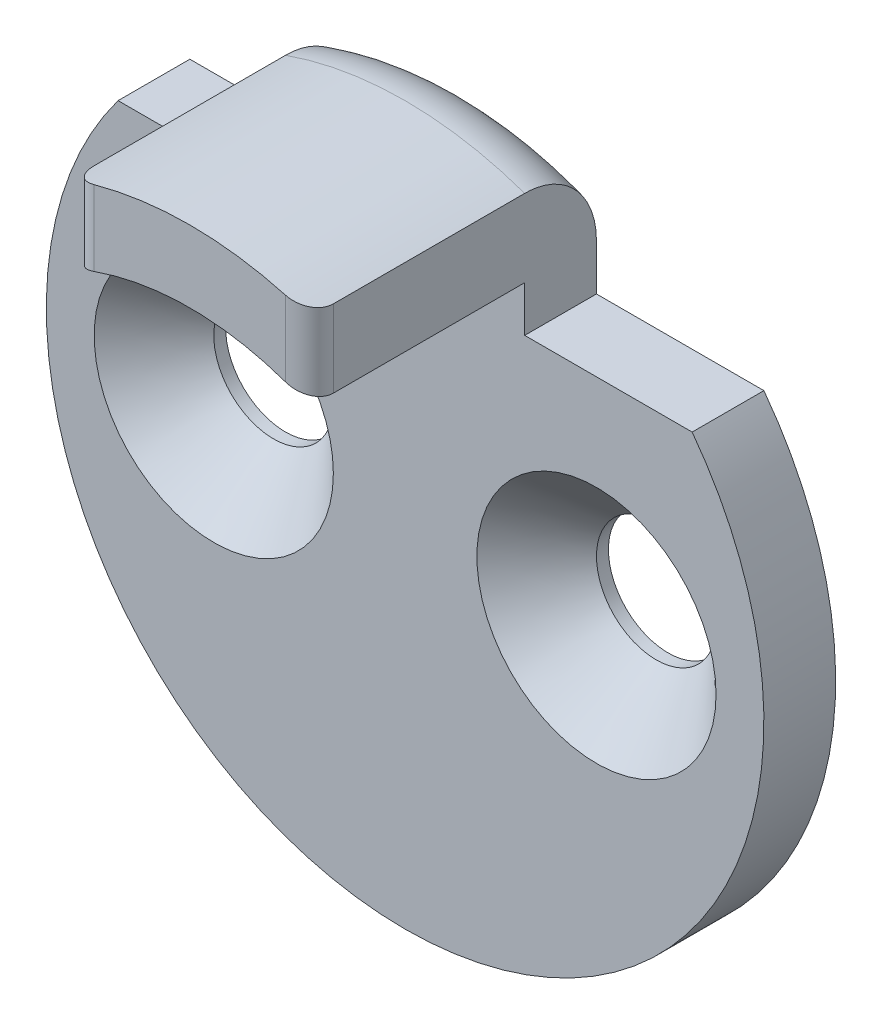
ISO-10303-21;
HEADER;
FILE_DESCRIPTION(('STEP AP214'),'2;1');
FILE_NAME('part.step','',(''),(''),'','','');
FILE_SCHEMA(('AUTOMOTIVE_DESIGN { 1 0 10303 214 1 1 1 1 }'));
ENDSEC;
DATA;
#1=APPLICATION_CONTEXT('core data for automotive mechanical design processes');
#2=APPLICATION_PROTOCOL_DEFINITION('international standard','automotive_design',2000,#1);
#3=PRODUCT_CONTEXT('',#1,'mechanical');
#4=PRODUCT('Part','Part','',(#3));
#5=PRODUCT_RELATED_PRODUCT_CATEGORY('part','',(#4));
#6=PRODUCT_DEFINITION_FORMATION('','',#4);
#7=PRODUCT_DEFINITION_CONTEXT('part definition',#1,'design');
#8=PRODUCT_DEFINITION('design','',#6,#7);
#9=PRODUCT_DEFINITION_SHAPE('','',#8);
#10=(LENGTH_UNIT() NAMED_UNIT(*) SI_UNIT(.MILLI.,.METRE.));
#11=(NAMED_UNIT(*) PLANE_ANGLE_UNIT() SI_UNIT($,.RADIAN.));
#12=(NAMED_UNIT(*) SI_UNIT($,.STERADIAN.) SOLID_ANGLE_UNIT());
#13=UNCERTAINTY_MEASURE_WITH_UNIT(LENGTH_MEASURE(1.E-05),#10,'distance_accuracy_value','');
#14=(GEOMETRIC_REPRESENTATION_CONTEXT(3) GLOBAL_UNCERTAINTY_ASSIGNED_CONTEXT((#13)) GLOBAL_UNIT_ASSIGNED_CONTEXT((#10,
#11,#12)) REPRESENTATION_CONTEXT('',''));
#15=CARTESIAN_POINT('',(0.,0.,0.));
#16=DIRECTION('',(0.,0.,1.));
#17=DIRECTION('',(1.,0.,0.));
#18=AXIS2_PLACEMENT_3D('',#15,#16,#17);
#19=CARTESIAN_POINT('',(0.,0.,1.5));
#20=DIRECTION('',(0.,0.,1.));
#21=DIRECTION('',(1.,0.,0.));
#22=AXIS2_PLACEMENT_3D('',#19,#20,#21);
#23=PLANE('',#22);
#24=CARTESIAN_POINT('',(-4.,0.,1.5));
#25=DIRECTION('',(0.,0.,1.));
#26=DIRECTION('',(1.,0.,0.));
#27=AXIS2_PLACEMENT_3D('',#24,#25,#26);
#28=CIRCLE('',#27,2.5);
#29=CARTESIAN_POINT('',(-1.5,0.,1.5));
#30=VERTEX_POINT('',#29);
#31=EDGE_CURVE('E39',#30,#30,#28,.F.);
#32=ORIENTED_EDGE('',*,*,#31,.T.);
#33=EDGE_LOOP('',(#32));
#34=FACE_BOUND('',#33,.T.);
#35=CARTESIAN_POINT('',(4.,0.,1.5));
#36=DIRECTION('',(0.,0.,1.));
#37=DIRECTION('',(1.,0.,0.));
#38=AXIS2_PLACEMENT_3D('',#35,#36,#37);
#39=CIRCLE('',#38,2.5);
#40=CARTESIAN_POINT('',(6.5,0.,1.5));
#41=VERTEX_POINT('',#40);
#42=EDGE_CURVE('E316',#41,#41,#39,.F.);
#43=ORIENTED_EDGE('',*,*,#42,.T.);
#44=EDGE_LOOP('',(#43));
#45=FACE_BOUND('',#44,.T.);
#46=CARTESIAN_POINT('',(0.,0.,1.5));
#47=DIRECTION('',(0.,0.,-1.));
#48=DIRECTION('',(1.,0.,0.));
#49=AXIS2_PLACEMENT_3D('',#46,#47,#48);
#50=CIRCLE('',#49,6.);
#51=CARTESIAN_POINT('',(-2.5,5.45435605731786,1.5));
#52=VERTEX_POINT('',#51);
#53=CARTESIAN_POINT('',(2.5,5.45435605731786,1.5));
#54=VERTEX_POINT('',#53);
#55=EDGE_CURVE('E125',#52,#54,#50,.T.);
#56=ORIENTED_EDGE('',*,*,#55,.F.);
#57=DIRECTION('',(0.,-1.,0.));
#58=VECTOR('',#57,1.);
#59=CARTESIAN_POINT('',(-2.5,4.5,1.5));
#60=LINE('',#59,#58);
#61=CARTESIAN_POINT('',(-2.5,4.5,1.5));
#62=VERTEX_POINT('',#61);
#63=EDGE_CURVE('E157',#52,#62,#60,.T.);
#64=ORIENTED_EDGE('',*,*,#63,.T.);
#65=DIRECTION('',(-1.,0.,0.));
#66=VECTOR('',#65,1.);
#67=CARTESIAN_POINT('',(-2.5,4.5,1.5));
#68=LINE('',#67,#66);
#69=CARTESIAN_POINT('',(-6.,4.5,1.5));
#70=VERTEX_POINT('',#69);
#71=EDGE_CURVE('E155',#62,#70,#68,.T.);
#72=ORIENTED_EDGE('',*,*,#71,.T.);
#73=CARTESIAN_POINT('',(0.,0.,1.5));
#74=DIRECTION('',(0.,0.,1.));
#75=DIRECTION('',(1.,0.,0.));
#76=AXIS2_PLACEMENT_3D('',#73,#74,#75);
#77=CIRCLE('',#76,7.5);
#78=CARTESIAN_POINT('',(6.,4.5,1.5));
#79=VERTEX_POINT('',#78);
#80=EDGE_CURVE('E185',#70,#79,#77,.T.);
#81=ORIENTED_EDGE('',*,*,#80,.T.);
#82=DIRECTION('',(-1.,0.,0.));
#83=VECTOR('',#82,1.);
#84=CARTESIAN_POINT('',(2.5,4.5,1.5));
#85=LINE('',#84,#83);
#86=CARTESIAN_POINT('',(2.5,4.5,1.5));
#87=VERTEX_POINT('',#86);
#88=EDGE_CURVE('E128',#79,#87,#85,.T.);
#89=ORIENTED_EDGE('',*,*,#88,.T.);
#90=DIRECTION('',(0.,1.,0.));
#91=VECTOR('',#90,1.);
#92=CARTESIAN_POINT('',(2.5,4.5,1.5));
#93=LINE('',#92,#91);
#94=EDGE_CURVE('E117',#87,#54,#93,.T.);
#95=ORIENTED_EDGE('',*,*,#94,.T.);
#96=EDGE_LOOP('',(#56,#64,#72,#81,#89,#95));
#97=FACE_BOUND('',#96,.T.);
#98=ADVANCED_FACE('F31',(#34,#45,#97),#23,.T.);
#99=CARTESIAN_POINT('',(0.,0.,0.));
#100=DIRECTION('',(0.,0.,1.));
#101=DIRECTION('',(1.,0.,0.));
#102=AXIS2_PLACEMENT_3D('',#99,#100,#101);
#103=PLANE('',#102);
#104=CARTESIAN_POINT('',(-4.,0.,0.));
#105=DIRECTION('',(0.,0.,1.));
#106=DIRECTION('',(1.,0.,0.));
#107=AXIS2_PLACEMENT_3D('',#104,#105,#106);
#108=CIRCLE('',#107,1.25);
#109=CARTESIAN_POINT('',(-2.75,0.,0.));
#110=VERTEX_POINT('',#109);
#111=EDGE_CURVE('E149',#110,#110,#108,.T.);
#112=ORIENTED_EDGE('',*,*,#111,.T.);
#113=EDGE_LOOP('',(#112));
#114=FACE_BOUND('',#113,.T.);
#115=DIRECTION('',(0.,-1.,0.));
#116=VECTOR('',#115,1.);
#117=CARTESIAN_POINT('',(-2.5,4.5,0.));
#118=LINE('',#117,#116);
#119=CARTESIAN_POINT('',(-2.5,5.45435605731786,0.));
#120=VERTEX_POINT('',#119);
#121=CARTESIAN_POINT('',(-2.5,4.5,0.));
#122=VERTEX_POINT('',#121);
#123=EDGE_CURVE('E152',#120,#122,#118,.T.);
#124=ORIENTED_EDGE('',*,*,#123,.F.);
#125=CARTESIAN_POINT('',(0.,0.,0.));
#126=DIRECTION('',(0.,0.,1.));
#127=DIRECTION('',(1.,0.,0.));
#128=AXIS2_PLACEMENT_3D('',#125,#126,#127);
#129=CIRCLE('',#128,6.);
#130=CARTESIAN_POINT('',(2.5,5.45435605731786,0.));
#131=VERTEX_POINT('',#130);
#132=EDGE_CURVE('E208',#120,#131,#129,.F.);
#133=ORIENTED_EDGE('',*,*,#132,.T.);
#134=DIRECTION('',(0.,1.,0.));
#135=VECTOR('',#134,1.);
#136=CARTESIAN_POINT('',(2.5,4.5,0.));
#137=LINE('',#136,#135);
#138=CARTESIAN_POINT('',(2.5,4.5,0.));
#139=VERTEX_POINT('',#138);
#140=EDGE_CURVE('E159',#139,#131,#137,.T.);
#141=ORIENTED_EDGE('',*,*,#140,.F.);
#142=DIRECTION('',(-1.,0.,0.));
#143=VECTOR('',#142,1.);
#144=CARTESIAN_POINT('',(2.5,4.5,0.));
#145=LINE('',#144,#143);
#146=CARTESIAN_POINT('',(6.,4.5,0.));
#147=VERTEX_POINT('',#146);
#148=EDGE_CURVE('E177',#147,#139,#145,.T.);
#149=ORIENTED_EDGE('',*,*,#148,.F.);
#150=CARTESIAN_POINT('',(0.,0.,0.));
#151=DIRECTION('',(0.,0.,1.));
#152=DIRECTION('',(1.,0.,0.));
#153=AXIS2_PLACEMENT_3D('',#150,#151,#152);
#154=CIRCLE('',#153,7.5);
#155=CARTESIAN_POINT('',(-6.,4.5,0.));
#156=VERTEX_POINT('',#155);
#157=EDGE_CURVE('E179',#156,#147,#154,.T.);
#158=ORIENTED_EDGE('',*,*,#157,.F.);
#159=DIRECTION('',(-1.,0.,0.));
#160=VECTOR('',#159,1.);
#161=CARTESIAN_POINT('',(-2.5,4.5,0.));
#162=LINE('',#161,#160);
#163=EDGE_CURVE('E181',#122,#156,#162,.T.);
#164=ORIENTED_EDGE('',*,*,#163,.F.);
#165=EDGE_LOOP('',(#124,#133,#141,#149,#158,#164));
#166=FACE_BOUND('',#165,.T.);
#167=CARTESIAN_POINT('',(4.,0.,0.));
#168=DIRECTION('',(0.,0.,1.));
#169=DIRECTION('',(1.,0.,0.));
#170=AXIS2_PLACEMENT_3D('',#167,#168,#169);
#171=CIRCLE('',#170,1.25);
#172=CARTESIAN_POINT('',(5.25,0.,0.));
#173=VERTEX_POINT('',#172);
#174=EDGE_CURVE('E146',#173,#173,#171,.T.);
#175=ORIENTED_EDGE('',*,*,#174,.T.);
#176=EDGE_LOOP('',(#175));
#177=FACE_BOUND('',#176,.T.);
#178=ADVANCED_FACE('F205',(#114,#166,#177),#103,.F.);
#179=CARTESIAN_POINT('',(-2.5,4.5,1.5));
#180=DIRECTION('',(1.,0.,0.));
#181=DIRECTION('',(0.,1.,0.));
#182=AXIS2_PLACEMENT_3D('',#179,#180,#181);
#183=PLANE('',#182);
#184=DIRECTION('',(0.,0.,-1.));
#185=VECTOR('',#184,1.);
#186=CARTESIAN_POINT('',(-2.5,5.45435605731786,6.));
#187=LINE('',#186,#185);
#188=CARTESIAN_POINT('',(-2.5,5.45435605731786,5.5));
#189=VERTEX_POINT('',#188);
#190=EDGE_CURVE('E120',#189,#52,#187,.T.);
#191=ORIENTED_EDGE('',*,*,#190,.F.);
#192=DIRECTION('',(0.,-1.,0.));
#193=VECTOR('',#192,1.);
#194=CARTESIAN_POINT('',(-2.5,7.07106781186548,5.5));
#195=LINE('',#194,#193);
#196=CARTESIAN_POINT('',(-2.5,7.07106781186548,5.5));
#197=VERTEX_POINT('',#196);
#198=EDGE_CURVE('E285',#189,#197,#195,.F.);
#199=ORIENTED_EDGE('',*,*,#198,.T.);
#200=DIRECTION('',(0.,0.,-1.));
#201=VECTOR('',#200,1.);
#202=CARTESIAN_POINT('',(-2.5,7.07106781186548,1.5));
#203=LINE('',#202,#201);
#204=CARTESIAN_POINT('',(-2.5,7.07106781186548,1.5));
#205=VERTEX_POINT('',#204);
#206=EDGE_CURVE('E130',#197,#205,#203,.T.);
#207=ORIENTED_EDGE('',*,*,#206,.T.);
#208=CARTESIAN_POINT('',(-2.5,7.07106781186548,1.5));
#209=CARTESIAN_POINT('',(-2.5,7.07106853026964,1.45965084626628));
#210=CARTESIAN_POINT('',(-2.5,7.06933982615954,1.4193215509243));
#211=CARTESIAN_POINT('',(-2.5,7.0624501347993,1.33896292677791));
#212=CARTESIAN_POINT('',(-2.5,7.05728963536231,1.29893355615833));
#213=CARTESIAN_POINT('',(-2.5,7.03674079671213,1.17990736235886));
#214=CARTESIAN_POINT('',(-2.5,7.01628474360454,1.10172685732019));
#215=CARTESIAN_POINT('',(-2.5,6.96258215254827,0.949945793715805));
#216=CARTESIAN_POINT('',(-2.5,6.9293353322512,0.876345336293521));
#217=CARTESIAN_POINT('',(-2.5,6.85119270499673,0.735600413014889));
#218=CARTESIAN_POINT('',(-2.5,6.8062944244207,0.668457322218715));
#219=CARTESIAN_POINT('',(-2.5,6.70528447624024,0.540965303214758));
#220=CARTESIAN_POINT('',(-2.5,6.6489614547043,0.480784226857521));
#221=CARTESIAN_POINT('',(-2.5,6.52747694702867,0.370151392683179));
#222=CARTESIAN_POINT('',(-2.5,6.46231432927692,0.31970088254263));
#223=CARTESIAN_POINT('',(-2.5,6.32130782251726,0.226997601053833));
#224=CARTESIAN_POINT('',(-2.5,6.2450773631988,0.185333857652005));
#225=CARTESIAN_POINT('',(-2.5,6.08701092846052,0.114417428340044));
#226=CARTESIAN_POINT('',(-2.5,6.0051712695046,0.0851729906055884));
#227=CARTESIAN_POINT('',(-2.5,5.8455323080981,0.0414208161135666));
#228=CARTESIAN_POINT('',(-2.5,5.76802536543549,0.0258298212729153));
#229=CARTESIAN_POINT('',(-2.5,5.6117864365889,0.00511891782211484));
#230=CARTESIAN_POINT('',(-2.5,5.53305739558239,-2.31176640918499E-05));
#231=CARTESIAN_POINT('',(-2.5,5.45435605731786,0.));
#232=B_SPLINE_CURVE_WITH_KNOTS('',3,(#208,#209,#210,#211,#212,#213,#214,#215,#216,#217,#218,
#219,#220,#221,#222,#223,#224,#225,#226,#227,#228,#229,#230,#231),.UNSPECIFIED.,.F.,.F.,(4,2,2,
2,2,2,2,2,2,2,2,4),(0.,0.120971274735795,0.241925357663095,0.483106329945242,0.724292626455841,
0.965530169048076,1.21172203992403,1.45794545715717,1.7174511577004,1.97712893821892,
2.21360438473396,2.44957854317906),.UNSPECIFIED.);
#233=EDGE_CURVE('E212',#205,#120,#232,.T.);
#234=ORIENTED_EDGE('',*,*,#233,.T.);
#235=ORIENTED_EDGE('',*,*,#123,.T.);
#236=DIRECTION('',(0.,0.,-1.));
#237=VECTOR('',#236,1.);
#238=CARTESIAN_POINT('',(-2.5,4.5,1.5));
#239=LINE('',#238,#237);
#240=EDGE_CURVE('E160',#62,#122,#239,.T.);
#241=ORIENTED_EDGE('',*,*,#240,.F.);
#242=ORIENTED_EDGE('',*,*,#63,.F.);
#243=EDGE_LOOP('',(#191,#199,#207,#234,#235,#241,#242));
#244=FACE_BOUND('',#243,.T.);
#245=ADVANCED_FACE('F244',(#244),#183,.F.);
#246=CARTESIAN_POINT('',(-2.5,4.5,1.5));
#247=DIRECTION('',(0.,-1.,0.));
#248=DIRECTION('',(1.,0.,0.));
#249=AXIS2_PLACEMENT_3D('',#246,#247,#248);
#250=PLANE('',#249);
#251=ORIENTED_EDGE('',*,*,#163,.T.);
#252=DIRECTION('',(0.,0.,-1.));
#253=VECTOR('',#252,1.);
#254=CARTESIAN_POINT('',(-6.,4.5,1.5));
#255=LINE('',#254,#253);
#256=EDGE_CURVE('E164',#70,#156,#255,.T.);
#257=ORIENTED_EDGE('',*,*,#256,.F.);
#258=ORIENTED_EDGE('',*,*,#71,.F.);
#259=ORIENTED_EDGE('',*,*,#240,.T.);
#260=EDGE_LOOP('',(#251,#257,#258,#259));
#261=FACE_BOUND('',#260,.T.);
#262=ADVANCED_FACE('F192',(#261),#250,.F.);
#263=CARTESIAN_POINT('',(0.,0.,1.5));
#264=DIRECTION('',(0.,0.,-1.));
#265=DIRECTION('',(-1.,0.,0.));
#266=AXIS2_PLACEMENT_3D('',#263,#264,#265);
#267=CYLINDRICAL_SURFACE('',#266,7.5);
#268=ORIENTED_EDGE('',*,*,#157,.T.);
#269=DIRECTION('',(0.,0.,-1.));
#270=VECTOR('',#269,1.);
#271=CARTESIAN_POINT('',(6.,4.5,1.5));
#272=LINE('',#271,#270);
#273=EDGE_CURVE('E167',#79,#147,#272,.T.);
#274=ORIENTED_EDGE('',*,*,#273,.F.);
#275=ORIENTED_EDGE('',*,*,#80,.F.);
#276=ORIENTED_EDGE('',*,*,#256,.T.);
#277=EDGE_LOOP('',(#268,#274,#275,#276));
#278=FACE_BOUND('',#277,.T.);
#279=ADVANCED_FACE('F196',(#278),#267,.T.);
#280=CARTESIAN_POINT('',(2.5,4.5,1.5));
#281=DIRECTION('',(0.,-1.,0.));
#282=DIRECTION('',(1.,0.,0.));
#283=AXIS2_PLACEMENT_3D('',#280,#281,#282);
#284=PLANE('',#283);
#285=ORIENTED_EDGE('',*,*,#148,.T.);
#286=DIRECTION('',(0.,0.,-1.));
#287=VECTOR('',#286,1.);
#288=CARTESIAN_POINT('',(2.5,4.5,1.5));
#289=LINE('',#288,#287);
#290=EDGE_CURVE('E170',#87,#139,#289,.T.);
#291=ORIENTED_EDGE('',*,*,#290,.F.);
#292=ORIENTED_EDGE('',*,*,#88,.F.);
#293=ORIENTED_EDGE('',*,*,#273,.T.);
#294=EDGE_LOOP('',(#285,#291,#292,#293));
#295=FACE_BOUND('',#294,.T.);
#296=ADVANCED_FACE('F199',(#295),#284,.F.);
#297=CARTESIAN_POINT('',(2.5,4.5,1.5));
#298=DIRECTION('',(-1.,0.,0.));
#299=DIRECTION('',(0.,-1.,0.));
#300=AXIS2_PLACEMENT_3D('',#297,#298,#299);
#301=PLANE('',#300);
#302=DIRECTION('',(0.,0.,-1.));
#303=VECTOR('',#302,1.);
#304=CARTESIAN_POINT('',(2.5,7.07106781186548,1.5));
#305=LINE('',#304,#303);
#306=CARTESIAN_POINT('',(2.5,7.07106781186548,5.5));
#307=VERTEX_POINT('',#306);
#308=CARTESIAN_POINT('',(2.5,7.07106781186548,1.5));
#309=VERTEX_POINT('',#308);
#310=EDGE_CURVE('E172',#307,#309,#305,.T.);
#311=ORIENTED_EDGE('',*,*,#310,.F.);
#312=DIRECTION('',(0.,1.,0.));
#313=VECTOR('',#312,1.);
#314=CARTESIAN_POINT('',(2.5,5.45435605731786,5.5));
#315=LINE('',#314,#313);
#316=CARTESIAN_POINT('',(2.5,5.45435605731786,5.5));
#317=VERTEX_POINT('',#316);
#318=EDGE_CURVE('E54',#307,#317,#315,.F.);
#319=ORIENTED_EDGE('',*,*,#318,.T.);
#320=DIRECTION('',(0.,0.,-1.));
#321=VECTOR('',#320,1.);
#322=CARTESIAN_POINT('',(2.5,5.45435605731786,6.));
#323=LINE('',#322,#321);
#324=EDGE_CURVE('E113',#317,#54,#323,.T.);
#325=ORIENTED_EDGE('',*,*,#324,.T.);
#326=ORIENTED_EDGE('',*,*,#94,.F.);
#327=ORIENTED_EDGE('',*,*,#290,.T.);
#328=ORIENTED_EDGE('',*,*,#140,.T.);
#329=CARTESIAN_POINT('',(2.5,5.45435605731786,0.));
#330=CARTESIAN_POINT('',(2.5,5.50300035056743,2.10913330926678E-06));
#331=CARTESIAN_POINT('',(2.5,5.55162579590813,0.00195679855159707));
#332=CARTESIAN_POINT('',(2.5,5.64857036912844,0.00982156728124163));
#333=CARTESIAN_POINT('',(2.5,5.69688939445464,0.0157329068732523));
#334=CARTESIAN_POINT('',(2.5,5.84111064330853,0.0395040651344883));
#335=CARTESIAN_POINT('',(2.5,5.93609902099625,0.0634014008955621));
#336=CARTESIAN_POINT('',(2.5,6.12074454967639,0.127280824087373));
#337=CARTESIAN_POINT('',(2.5,6.21038869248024,0.167300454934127));
#338=CARTESIAN_POINT('',(2.5,6.38094331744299,0.262785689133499));
#339=CARTESIAN_POINT('',(2.5,6.46186620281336,0.31822894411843));
#340=CARTESIAN_POINT('',(2.5,6.60715492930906,0.439303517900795));
#341=CARTESIAN_POINT('',(2.5,6.67224585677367,0.50406429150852));
#342=CARTESIAN_POINT('',(2.5,6.7896376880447,0.644365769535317));
#343=CARTESIAN_POINT('',(2.5,6.84193747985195,0.719907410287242));
#344=CARTESIAN_POINT('',(2.5,6.92834645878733,0.873727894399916));
#345=CARTESIAN_POINT('',(2.5,6.96348396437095,0.951431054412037));
#346=CARTESIAN_POINT('',(2.5,7.01943608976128,1.11177344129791));
#347=CARTESIAN_POINT('',(2.5,7.04027334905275,1.19440463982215));
#348=CARTESIAN_POINT('',(2.5,7.05939347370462,1.31484386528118));
#349=CARTESIAN_POINT('',(2.5,7.06377103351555,1.35176910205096));
#350=CARTESIAN_POINT('',(2.5,7.06960532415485,1.42578988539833));
#351=CARTESIAN_POINT('',(2.5,7.07106673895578,1.46288506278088));
#352=CARTESIAN_POINT('',(2.5,7.07106781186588,1.49999999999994));
#353=B_SPLINE_CURVE_WITH_KNOTS('',3,(#329,#330,#331,#332,#333,#334,#335,#336,#337,#338,#339,
#340,#341,#342,#343,#344,#345,#346,#347,#348,#349,#350,#351,#352),.UNSPECIFIED.,.F.,.F.,(4,2,2,
2,2,2,2,2,2,2,2,4),(0.,0.145853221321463,0.291752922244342,0.584079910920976,0.877091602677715,
1.16968092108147,1.44369010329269,1.71772309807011,1.97228883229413,2.22645061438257,
2.33790664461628,2.44918350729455),.UNSPECIFIED.);
#354=EDGE_CURVE('E211',#131,#309,#353,.T.);
#355=ORIENTED_EDGE('',*,*,#354,.T.);
#356=EDGE_LOOP('',(#311,#319,#325,#326,#327,#328,#355));
#357=FACE_BOUND('',#356,.T.);
#358=ADVANCED_FACE('F115',(#357),#301,.F.);
#359=CARTESIAN_POINT('',(0.,0.,1.5));
#360=DIRECTION('',(0.,0.,-1.));
#361=DIRECTION('',(-1.,0.,0.));
#362=AXIS2_PLACEMENT_3D('',#359,#360,#361);
#363=CYLINDRICAL_SURFACE('',#362,7.5);
#364=CARTESIAN_POINT('',(0.,0.,6.));
#365=DIRECTION('',(0.,0.,1.));
#366=DIRECTION('',(1.,0.,0.));
#367=AXIS2_PLACEMENT_3D('',#364,#365,#366);
#368=CIRCLE('',#367,7.5);
#369=CARTESIAN_POINT('',(2.,7.22841614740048,6.));
#370=VERTEX_POINT('',#369);
#371=CARTESIAN_POINT('',(-2.,7.22841614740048,6.));
#372=VERTEX_POINT('',#371);
#373=EDGE_CURVE('E133',#370,#372,#368,.T.);
#374=ORIENTED_EDGE('',*,*,#373,.F.);
#375=CARTESIAN_POINT('',(2.,7.22841614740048,6.));
#376=CARTESIAN_POINT('',(2.0292375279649,7.22033382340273,6.00001787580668));
#377=CARTESIAN_POINT('',(2.05841310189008,7.21206333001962,5.99743681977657));
#378=CARTESIAN_POINT('',(2.11584539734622,7.19541965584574,5.98726312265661));
#379=CARTESIAN_POINT('',(2.14410219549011,7.18704648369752,5.97967090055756));
#380=CARTESIAN_POINT('',(2.19891850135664,7.17046622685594,5.95965694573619));
#381=CARTESIAN_POINT('',(2.22547730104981,7.162259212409,5.94723321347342));
#382=CARTESIAN_POINT('',(2.27612228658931,7.14632566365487,5.91786669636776));
#383=CARTESIAN_POINT('',(2.30020907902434,7.13859901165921,5.90092502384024));
#384=CARTESIAN_POINT('',(2.34497559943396,7.12401853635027,5.8631016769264));
#385=CARTESIAN_POINT('',(2.36568414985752,7.11715745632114,5.84225699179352));
#386=CARTESIAN_POINT('',(2.40326665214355,7.10455510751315,5.79705096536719));
#387=CARTESIAN_POINT('',(2.42014056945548,7.0988138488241,5.77268959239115));
#388=CARTESIAN_POINT('',(2.4487915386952,7.08898021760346,5.72224325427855));
#389=CARTESIAN_POINT('',(2.46075483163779,7.08482810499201,5.69627565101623));
#390=CARTESIAN_POINT('',(2.48010681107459,7.07807718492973,5.6425153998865));
#391=CARTESIAN_POINT('',(2.48750198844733,7.07547617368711,5.61472540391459));
#392=CARTESIAN_POINT('',(2.49496972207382,7.07284471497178,5.57222024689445));
#393=CARTESIAN_POINT('',(2.49685497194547,7.07217915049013,5.55783965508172));
#394=CARTESIAN_POINT('',(2.49936947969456,7.07129076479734,5.52897533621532));
#395=CARTESIAN_POINT('',(2.50000044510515,7.07106734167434,5.51449177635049));
#396=CARTESIAN_POINT('',(2.50000000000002,7.07106781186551,5.5));
#397=B_SPLINE_CURVE_WITH_KNOTS('',3,(#375,#376,#377,#378,#379,#380,#381,#382,#383,#384,#385,
#386,#387,#388,#389,#390,#391,#392,#393,#394,#395,#396),.UNSPECIFIED.,.F.,.F.,(4,2,2,2,2,2,2,2,
2,2,4),(0.,0.0908795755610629,0.181751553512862,0.27266117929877,0.363548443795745,
0.453614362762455,0.543681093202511,0.629917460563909,0.716031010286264,0.759534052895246,
0.802977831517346),.UNSPECIFIED.);
#398=EDGE_CURVE('E295',#370,#307,#397,.T.);
#399=ORIENTED_EDGE('',*,*,#398,.T.);
#400=ORIENTED_EDGE('',*,*,#310,.T.);
#401=CARTESIAN_POINT('',(0.,0.,1.5));
#402=DIRECTION('',(0.,0.,1.));
#403=DIRECTION('',(1.,0.,0.));
#404=AXIS2_PLACEMENT_3D('',#401,#402,#403);
#405=CIRCLE('',#404,7.5);
#406=EDGE_CURVE('E163',#309,#205,#405,.T.);
#407=ORIENTED_EDGE('',*,*,#406,.T.);
#408=ORIENTED_EDGE('',*,*,#206,.F.);
#409=CARTESIAN_POINT('',(-2.5,7.07106781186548,5.5));
#410=CARTESIAN_POINT('',(-2.50002840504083,7.07105333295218,5.52704108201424));
#411=CARTESIAN_POINT('',(-2.49780830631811,7.07184266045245,5.55406378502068));
#412=CARTESIAN_POINT('',(-2.48909394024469,7.07491689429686,5.60725577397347));
#413=CARTESIAN_POINT('',(-2.48261052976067,7.07719800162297,5.6334270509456));
#414=CARTESIAN_POINT('',(-2.4655918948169,7.08314425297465,5.68423969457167));
#415=CARTESIAN_POINT('',(-2.45505740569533,7.08680914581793,5.70888133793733));
#416=CARTESIAN_POINT('',(-2.43030659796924,7.09533521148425,5.75601712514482));
#417=CARTESIAN_POINT('',(-2.41608901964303,7.10019679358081,5.77851053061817));
#418=CARTESIAN_POINT('',(-2.38398574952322,7.1110410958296,5.82139019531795));
#419=CARTESIAN_POINT('',(-2.36601147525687,7.11705051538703,5.84170326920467));
#420=CARTESIAN_POINT('',(-2.3271711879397,7.12984516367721,5.87905868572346));
#421=CARTESIAN_POINT('',(-2.30630427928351,7.13663063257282,5.89610001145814));
#422=CARTESIAN_POINT('',(-2.26107871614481,7.15109185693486,5.92735520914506));
#423=CARTESIAN_POINT('',(-2.23659445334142,7.15879562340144,5.94137435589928));
#424=CARTESIAN_POINT('',(-2.18570255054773,7.17449741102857,5.9650831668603));
#425=CARTESIAN_POINT('',(-2.15929516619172,7.18249539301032,5.9747734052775));
#426=CARTESIAN_POINT('',(-2.11076133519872,7.19688745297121,5.9880879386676));
#427=CARTESIAN_POINT('',(-2.08885791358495,7.20327655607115,5.99254555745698));
#428=CARTESIAN_POINT('',(-2.0446490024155,7.21595090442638,5.99850232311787));
#429=CARTESIAN_POINT('',(-2.02234396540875,7.22223625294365,6.0000046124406));
#430=CARTESIAN_POINT('',(-2.,7.22841614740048,6.));
#431=B_SPLINE_CURVE_WITH_KNOTS('',3,(#409,#410,#411,#412,#413,#414,#415,#416,#417,#418,#419,
#420,#421,#422,#423,#424,#425,#426,#427,#428,#429,#430),.UNSPECIFIED.,.F.,.F.,(4,2,2,2,2,2,2,2,
2,2,4),(0.,0.0809923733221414,0.161779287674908,0.242551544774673,0.323351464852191,
0.406330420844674,0.489335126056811,0.576685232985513,0.664023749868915,0.733580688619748,
0.803063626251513),.UNSPECIFIED.);
#432=EDGE_CURVE('E300',#197,#372,#431,.T.);
#433=ORIENTED_EDGE('',*,*,#432,.T.);
#434=EDGE_LOOP('',(#374,#399,#400,#407,#408,#433));
#435=FACE_BOUND('',#434,.T.);
#436=ADVANCED_FACE('F236',(#435),#363,.T.);
#437=CARTESIAN_POINT('',(-4.,0.,1.5));
#438=DIRECTION('',(0.,0.,-1.));
#439=DIRECTION('',(-1.,0.,0.));
#440=AXIS2_PLACEMENT_3D('',#437,#438,#439);
#441=CYLINDRICAL_SURFACE('',#440,1.25);
#442=CARTESIAN_POINT('',(-4.,0.,0.250000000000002));
#443=DIRECTION('',(0.,0.,1.));
#444=DIRECTION('',(1.,0.,0.));
#445=AXIS2_PLACEMENT_3D('',#442,#443,#444);
#446=CIRCLE('',#445,1.25);
#447=CARTESIAN_POINT('',(-2.75,0.,0.250000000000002));
#448=VERTEX_POINT('',#447);
#449=EDGE_CURVE('E314',#448,#448,#446,.T.);
#450=ORIENTED_EDGE('',*,*,#449,.T.);
#451=EDGE_LOOP('',(#450));
#452=FACE_BOUND('',#451,.T.);
#453=ORIENTED_EDGE('',*,*,#111,.F.);
#454=EDGE_LOOP('',(#453));
#455=FACE_BOUND('',#454,.T.);
#456=ADVANCED_FACE('F260',(#452,#455),#441,.F.);
#457=CARTESIAN_POINT('',(4.,0.,1.5));
#458=DIRECTION('',(0.,0.,-1.));
#459=DIRECTION('',(-1.,0.,0.));
#460=AXIS2_PLACEMENT_3D('',#457,#458,#459);
#461=CYLINDRICAL_SURFACE('',#460,1.25);
#462=CARTESIAN_POINT('',(4.,0.,0.250000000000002));
#463=DIRECTION('',(0.,0.,1.));
#464=DIRECTION('',(1.,0.,0.));
#465=AXIS2_PLACEMENT_3D('',#462,#463,#464);
#466=CIRCLE('',#465,1.25);
#467=CARTESIAN_POINT('',(5.25,0.,0.250000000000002));
#468=VERTEX_POINT('',#467);
#469=EDGE_CURVE('E11',#468,#468,#466,.T.);
#470=ORIENTED_EDGE('',*,*,#469,.T.);
#471=EDGE_LOOP('',(#470));
#472=FACE_BOUND('',#471,.T.);
#473=ORIENTED_EDGE('',*,*,#174,.F.);
#474=EDGE_LOOP('',(#473));
#475=FACE_BOUND('',#474,.T.);
#476=ADVANCED_FACE('F263',(#472,#475),#461,.F.);
#477=CARTESIAN_POINT('',(0.,0.,6.));
#478=DIRECTION('',(0.,0.,-1.));
#479=DIRECTION('',(-1.,0.,0.));
#480=AXIS2_PLACEMENT_3D('',#477,#478,#479);
#481=CYLINDRICAL_SURFACE('',#480,6.);
#482=ORIENTED_EDGE('',*,*,#324,.F.);
#483=CARTESIAN_POINT('',(2.5,5.45435605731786,5.5));
#484=CARTESIAN_POINT('',(2.5000305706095,5.4543365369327,5.52640819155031));
#485=CARTESIAN_POINT('',(2.49791003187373,5.45531398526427,5.55279140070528));
#486=CARTESIAN_POINT('',(2.48961283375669,5.45910837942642,5.60468449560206));
#487=CARTESIAN_POINT('',(2.48345045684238,5.46191884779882,5.63019712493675));
#488=CARTESIAN_POINT('',(2.46731729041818,5.46922467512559,5.67970719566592));
#489=CARTESIAN_POINT('',(2.4573487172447,5.47371905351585,5.70370550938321));
#490=CARTESIAN_POINT('',(2.43398616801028,5.4841476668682,5.74963996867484));
#491=CARTESIAN_POINT('',(2.42059003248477,5.49008280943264,5.77157480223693));
#492=CARTESIAN_POINT('',(2.39018742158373,5.50338891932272,5.8137807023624));
#493=CARTESIAN_POINT('',(2.37305362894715,5.51080946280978,5.83394416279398));
#494=CARTESIAN_POINT('',(2.33605635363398,5.52659436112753,5.87115372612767));
#495=CARTESIAN_POINT('',(2.31619194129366,5.53495903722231,5.88819876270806));
#496=CARTESIAN_POINT('',(2.27247653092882,5.55305814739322,5.92017873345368));
#497=CARTESIAN_POINT('',(2.24843078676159,5.56284861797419,5.93481587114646));
#498=CARTESIAN_POINT('',(2.19836408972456,5.58282387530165,5.9598205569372));
#499=CARTESIAN_POINT('',(2.17234288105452,5.59300871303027,5.97018755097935));
#500=CARTESIAN_POINT('',(2.12210655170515,5.61224524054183,5.98548515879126));
#501=CARTESIAN_POINT('',(2.09803805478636,5.62128958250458,5.99091112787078));
#502=CARTESIAN_POINT('',(2.04933587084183,5.63922947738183,5.9981697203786));
#503=CARTESIAN_POINT('',(2.02470268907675,5.64812515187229,6.00000543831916));
#504=CARTESIAN_POINT('',(2.,5.65685424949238,6.));
#505=B_SPLINE_CURVE_WITH_KNOTS('',3,(#483,#484,#485,#486,#487,#488,#489,#490,#491,#492,#493,
#494,#495,#496,#497,#498,#499,#500,#501,#502,#503,#504),.UNSPECIFIED.,.F.,.F.,(4,2,2,2,2,2,2,2,
2,2,4),(0.,0.0790824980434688,0.157887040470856,0.236645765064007,0.315454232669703,
0.397550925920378,0.47967563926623,0.568703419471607,0.657742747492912,0.736328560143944,
0.814846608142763),.UNSPECIFIED.);
#506=CARTESIAN_POINT('',(2.,5.65685424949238,6.));
#507=VERTEX_POINT('',#506);
#508=EDGE_CURVE('E280',#317,#507,#505,.T.);
#509=ORIENTED_EDGE('',*,*,#508,.T.);
#510=CARTESIAN_POINT('',(0.,0.,6.));
#511=DIRECTION('',(0.,0.,-1.));
#512=DIRECTION('',(1.,0.,0.));
#513=AXIS2_PLACEMENT_3D('',#510,#511,#512);
#514=CIRCLE('',#513,6.);
#515=CARTESIAN_POINT('',(-2.,5.65685424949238,6.));
#516=VERTEX_POINT('',#515);
#517=EDGE_CURVE('E121',#516,#507,#514,.T.);
#518=ORIENTED_EDGE('',*,*,#517,.F.);
#519=CARTESIAN_POINT('',(-2.,5.65685424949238,6.));
#520=CARTESIAN_POINT('',(-2.02994654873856,5.64627668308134,6.00001346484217));
#521=CARTESIAN_POINT('',(-2.05979179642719,5.63544747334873,5.99731087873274));
#522=CARTESIAN_POINT('',(-2.11849026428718,5.61363955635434,5.98666854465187));
#523=CARTESIAN_POINT('',(-2.14734315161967,5.60266080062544,5.97872705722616));
#524=CARTESIAN_POINT('',(-2.20325625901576,5.58091129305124,5.95779846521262));
#525=CARTESIAN_POINT('',(-2.2303158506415,5.57014061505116,5.94480960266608));
#526=CARTESIAN_POINT('',(-2.28185339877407,5.54922666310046,5.91407494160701));
#527=CARTESIAN_POINT('',(-2.30633200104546,5.53908323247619,5.8963303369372));
#528=CARTESIAN_POINT('',(-2.35159011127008,5.52001988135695,5.85675577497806));
#529=CARTESIAN_POINT('',(-2.37241903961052,5.51108406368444,5.83499022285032));
#530=CARTESIAN_POINT('',(-2.41004644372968,5.49473366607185,5.78770373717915));
#531=CARTESIAN_POINT('',(-2.42684562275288,5.48731882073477,5.76218346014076));
#532=CARTESIAN_POINT('',(-2.45464985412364,5.47493473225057,5.71001374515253));
#533=CARTESIAN_POINT('',(-2.46597846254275,5.46983051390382,5.68356878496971));
#534=CARTESIAN_POINT('',(-2.48396323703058,5.46168709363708,5.62885845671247));
#535=CARTESIAN_POINT('',(-2.49062871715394,5.45864377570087,5.60059684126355));
#536=CARTESIAN_POINT('',(-2.49652939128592,5.45594571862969,5.56003540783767));
#537=CARTESIAN_POINT('',(-2.49783030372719,5.45535011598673,5.54806533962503));
#538=CARTESIAN_POINT('',(-2.49956485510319,5.45455554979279,5.52406577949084));
#539=CARTESIAN_POINT('',(-2.49999966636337,5.45435605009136,5.51203639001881));
#540=CARTESIAN_POINT('',(-2.5,5.45435605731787,5.5));
#541=B_SPLINE_CURVE_WITH_KNOTS('',3,(#519,#520,#521,#522,#523,#524,#525,#526,#527,#528,#529,
#530,#531,#532,#533,#534,#535,#536,#537,#538,#539,#540),.UNSPECIFIED.,.F.,.F.,(4,2,2,2,2,2,2,2,
2,2,4),(0.,0.0951486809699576,0.190328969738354,0.285542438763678,0.380732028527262,
0.474511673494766,0.568274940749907,0.655467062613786,0.742484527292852,0.778619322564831,
0.814705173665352),.UNSPECIFIED.);
#542=EDGE_CURVE('E46',#516,#189,#541,.T.);
#543=ORIENTED_EDGE('',*,*,#542,.T.);
#544=ORIENTED_EDGE('',*,*,#190,.T.);
#545=ORIENTED_EDGE('',*,*,#55,.T.);
#546=EDGE_LOOP('',(#482,#509,#518,#543,#544,#545));
#547=FACE_BOUND('',#546,.T.);
#548=ADVANCED_FACE('F132',(#547),#481,.F.);
#549=CARTESIAN_POINT('',(0.,0.,6.));
#550=DIRECTION('',(0.,0.,1.));
#551=DIRECTION('',(1.,0.,0.));
#552=AXIS2_PLACEMENT_3D('',#549,#550,#551);
#553=PLANE('',#552);
#554=ORIENTED_EDGE('',*,*,#517,.T.);
#555=DIRECTION('',(0.,1.,0.));
#556=VECTOR('',#555,1.);
#557=CARTESIAN_POINT('',(2.,7.07106781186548,6.));
#558=LINE('',#557,#556);
#559=EDGE_CURVE('E334',#507,#370,#558,.T.);
#560=ORIENTED_EDGE('',*,*,#559,.T.);
#561=ORIENTED_EDGE('',*,*,#373,.T.);
#562=DIRECTION('',(0.,-1.,0.));
#563=VECTOR('',#562,1.);
#564=CARTESIAN_POINT('',(-2.,5.45435605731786,6.));
#565=LINE('',#564,#563);
#566=EDGE_CURVE('E214',#372,#516,#565,.T.);
#567=ORIENTED_EDGE('',*,*,#566,.T.);
#568=EDGE_LOOP('',(#554,#560,#561,#567));
#569=FACE_BOUND('',#568,.T.);
#570=ADVANCED_FACE('F271',(#569),#553,.T.);
#571=CARTESIAN_POINT('',(0.,0.,1.5));
#572=DIRECTION('',(0.,0.,1.));
#573=DIRECTION('',(1.,0.,0.));
#574=AXIS2_PLACEMENT_3D('',#571,#572,#573);
#575=TOROIDAL_SURFACE('',#574,6.,1.5);
#576=ORIENTED_EDGE('',*,*,#354,.F.);
#577=ORIENTED_EDGE('',*,*,#132,.F.);
#578=ORIENTED_EDGE('',*,*,#233,.F.);
#579=ORIENTED_EDGE('',*,*,#406,.F.);
#580=EDGE_LOOP('',(#576,#577,#578,#579));
#581=FACE_BOUND('',#580,.T.);
#582=ADVANCED_FACE('F229',(#581),#575,.T.);
#583=CARTESIAN_POINT('',(2.,0.,5.5));
#584=DIRECTION('',(0.,-1.,0.));
#585=DIRECTION('',(1.,0.,0.));
#586=AXIS2_PLACEMENT_3D('',#583,#584,#585);
#587=CYLINDRICAL_SURFACE('',#586,0.5);
#588=ORIENTED_EDGE('',*,*,#508,.F.);
#589=ORIENTED_EDGE('',*,*,#318,.F.);
#590=ORIENTED_EDGE('',*,*,#398,.F.);
#591=ORIENTED_EDGE('',*,*,#559,.F.);
#592=EDGE_LOOP('',(#588,#589,#590,#591));
#593=FACE_BOUND('',#592,.T.);
#594=ADVANCED_FACE('F287',(#593),#587,.T.);
#595=CARTESIAN_POINT('',(-2.,0.,5.5));
#596=DIRECTION('',(0.,1.,0.));
#597=DIRECTION('',(-1.,0.,0.));
#598=AXIS2_PLACEMENT_3D('',#595,#596,#597);
#599=CYLINDRICAL_SURFACE('',#598,0.5);
#600=ORIENTED_EDGE('',*,*,#432,.F.);
#601=ORIENTED_EDGE('',*,*,#198,.F.);
#602=ORIENTED_EDGE('',*,*,#542,.F.);
#603=ORIENTED_EDGE('',*,*,#566,.F.);
#604=EDGE_LOOP('',(#600,#601,#602,#603));
#605=FACE_BOUND('',#604,.T.);
#606=ADVANCED_FACE('F290',(#605),#599,.T.);
#607=CARTESIAN_POINT('',(-4.,0.,0.250000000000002));
#608=DIRECTION('',(0.,0.,1.));
#609=DIRECTION('',(1.,0.,0.));
#610=AXIS2_PLACEMENT_3D('',#607,#608,#609);
#611=CONICAL_SURFACE('',#610,1.25,0.78539816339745);
#612=ORIENTED_EDGE('',*,*,#31,.F.);
#613=EDGE_LOOP('',(#612));
#614=FACE_BOUND('',#613,.T.);
#615=ORIENTED_EDGE('',*,*,#449,.F.);
#616=EDGE_LOOP('',(#615));
#617=FACE_BOUND('',#616,.T.);
#618=ADVANCED_FACE('F322',(#614,#617),#611,.F.);
#619=CARTESIAN_POINT('',(4.,0.,0.250000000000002));
#620=DIRECTION('',(0.,0.,1.));
#621=DIRECTION('',(1.,0.,0.));
#622=AXIS2_PLACEMENT_3D('',#619,#620,#621);
#623=CONICAL_SURFACE('',#622,1.25,0.78539816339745);
#624=ORIENTED_EDGE('',*,*,#42,.F.);
#625=EDGE_LOOP('',(#624));
#626=FACE_BOUND('',#625,.T.);
#627=ORIENTED_EDGE('',*,*,#469,.F.);
#628=EDGE_LOOP('',(#627));
#629=FACE_BOUND('',#628,.T.);
#630=ADVANCED_FACE('F33',(#626,#629),#623,.F.);
#631=CLOSED_SHELL('',(#98,#178,#245,#262,#279,#296,#358,#436,#456,#476,#548,#570,#582,#594,#606,
#618,#630));
#632=MANIFOLD_SOLID_BREP('B2',#631);
#633=ADVANCED_BREP_SHAPE_REPRESENTATION('',(#18,#632),#14);
#634=SHAPE_DEFINITION_REPRESENTATION(#9,#633);
ENDSEC;
END-ISO-10303-21;
